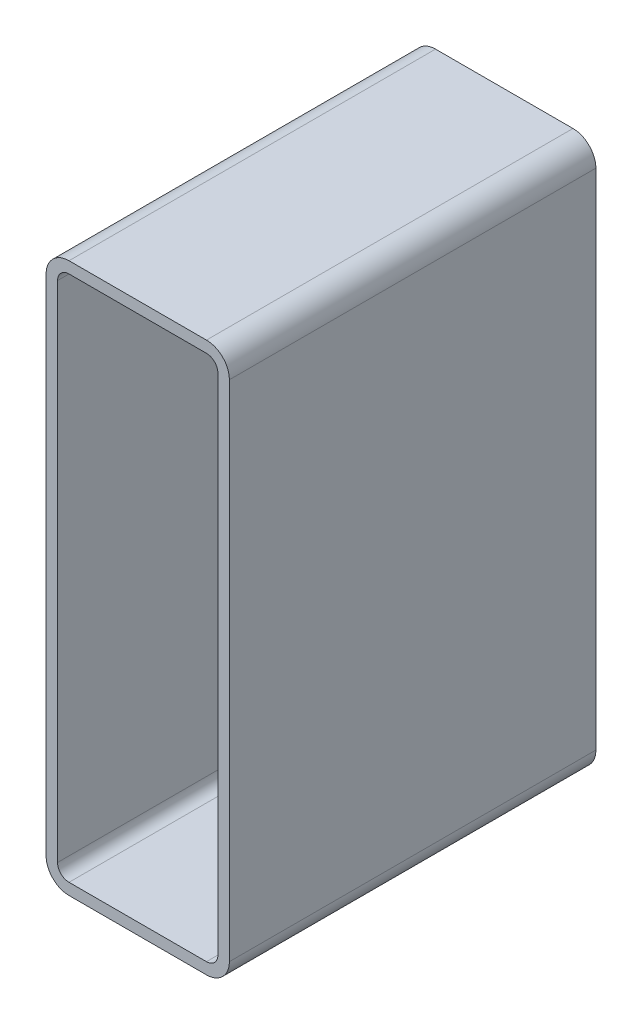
ISO-10303-21;
HEADER;
FILE_DESCRIPTION(('STEP AP214'),'2;1');
FILE_NAME('part.step','',(''),(''),'','','');
FILE_SCHEMA(('AUTOMOTIVE_DESIGN { 1 0 10303 214 1 1 1 1 }'));
ENDSEC;
DATA;
#1=APPLICATION_CONTEXT('core data for automotive mechanical design processes');
#2=APPLICATION_PROTOCOL_DEFINITION('international standard','automotive_design',2000,#1);
#3=PRODUCT_CONTEXT('',#1,'mechanical');
#4=PRODUCT('Part','Part','',(#3));
#5=PRODUCT_RELATED_PRODUCT_CATEGORY('part','',(#4));
#6=PRODUCT_DEFINITION_FORMATION('','',#4);
#7=PRODUCT_DEFINITION_CONTEXT('part definition',#1,'design');
#8=PRODUCT_DEFINITION('design','',#6,#7);
#9=PRODUCT_DEFINITION_SHAPE('','',#8);
#10=(LENGTH_UNIT() NAMED_UNIT(*) SI_UNIT(.MILLI.,.METRE.));
#11=(NAMED_UNIT(*) PLANE_ANGLE_UNIT() SI_UNIT($,.RADIAN.));
#12=(NAMED_UNIT(*) SI_UNIT($,.STERADIAN.) SOLID_ANGLE_UNIT());
#13=UNCERTAINTY_MEASURE_WITH_UNIT(LENGTH_MEASURE(1.E-05),#10,'distance_accuracy_value','');
#14=(GEOMETRIC_REPRESENTATION_CONTEXT(3) GLOBAL_UNCERTAINTY_ASSIGNED_CONTEXT((#13)) GLOBAL_UNIT_ASSIGNED_CONTEXT((#10,
#11,#12)) REPRESENTATION_CONTEXT('',''));
#15=CARTESIAN_POINT('',(0.,0.,0.));
#16=DIRECTION('',(0.,0.,1.));
#17=DIRECTION('',(1.,0.,0.));
#18=AXIS2_PLACEMENT_3D('',#15,#16,#17);
#19=CARTESIAN_POINT('',(19.0973013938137,439.887045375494,304.8));
#20=DIRECTION('',(0.,0.,1.));
#21=DIRECTION('',(1.,0.,0.));
#22=AXIS2_PLACEMENT_3D('',#19,#20,#21);
#23=PLANE('',#22);
#24=CARTESIAN_POINT('',(19.0973013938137,439.887045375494,304.8));
#25=DIRECTION('',(0.,0.,1.));
#26=DIRECTION('',(1.,0.,0.));
#27=AXIS2_PLACEMENT_3D('',#24,#25,#26);
#28=CIRCLE('',#27,19.05);
#29=CARTESIAN_POINT('',(19.0973013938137,458.937045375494,304.8));
#30=VERTEX_POINT('',#29);
#31=CARTESIAN_POINT('',(0.0473013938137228,439.887045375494,304.8));
#32=VERTEX_POINT('',#31);
#33=EDGE_CURVE('E211',#30,#32,#28,.T.);
#34=ORIENTED_EDGE('',*,*,#33,.T.);
#35=DIRECTION('',(0.,-1.,0.));
#36=VECTOR('',#35,1.);
#37=CARTESIAN_POINT('',(0.0473013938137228,20.7870453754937,304.8));
#38=LINE('',#37,#36);
#39=CARTESIAN_POINT('',(0.0473013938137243,20.7870453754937,304.8));
#40=VERTEX_POINT('',#39);
#41=EDGE_CURVE('E214',#32,#40,#38,.T.);
#42=ORIENTED_EDGE('',*,*,#41,.T.);
#43=CARTESIAN_POINT('',(19.0973013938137,20.7870453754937,304.8));
#44=DIRECTION('',(0.,0.,1.));
#45=DIRECTION('',(1.,0.,0.));
#46=AXIS2_PLACEMENT_3D('',#43,#44,#45);
#47=CIRCLE('',#46,19.05);
#48=CARTESIAN_POINT('',(19.0973013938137,1.73704537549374,304.8));
#49=VERTEX_POINT('',#48);
#50=EDGE_CURVE('E217',#40,#49,#47,.T.);
#51=ORIENTED_EDGE('',*,*,#50,.T.);
#52=DIRECTION('',(1.,0.,0.));
#53=VECTOR('',#52,1.);
#54=CARTESIAN_POINT('',(133.397301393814,1.73704537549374,304.8));
#55=LINE('',#54,#53);
#56=CARTESIAN_POINT('',(133.397301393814,1.73704537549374,304.8));
#57=VERTEX_POINT('',#56);
#58=EDGE_CURVE('E219',#49,#57,#55,.T.);
#59=ORIENTED_EDGE('',*,*,#58,.T.);
#60=CARTESIAN_POINT('',(133.397301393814,20.7870453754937,304.8));
#61=DIRECTION('',(0.,0.,1.));
#62=DIRECTION('',(1.,0.,0.));
#63=AXIS2_PLACEMENT_3D('',#60,#61,#62);
#64=CIRCLE('',#63,19.05);
#65=CARTESIAN_POINT('',(152.447301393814,20.7870453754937,304.8));
#66=VERTEX_POINT('',#65);
#67=EDGE_CURVE('E221',#57,#66,#64,.T.);
#68=ORIENTED_EDGE('',*,*,#67,.T.);
#69=DIRECTION('',(0.,1.,0.));
#70=VECTOR('',#69,1.);
#71=CARTESIAN_POINT('',(152.447301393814,439.887045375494,304.8));
#72=LINE('',#71,#70);
#73=CARTESIAN_POINT('',(152.447301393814,439.887045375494,304.8));
#74=VERTEX_POINT('',#73);
#75=EDGE_CURVE('E223',#66,#74,#72,.T.);
#76=ORIENTED_EDGE('',*,*,#75,.T.);
#77=CARTESIAN_POINT('',(133.397301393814,439.887045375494,304.8));
#78=DIRECTION('',(0.,0.,1.));
#79=DIRECTION('',(1.,0.,0.));
#80=AXIS2_PLACEMENT_3D('',#77,#78,#79);
#81=CIRCLE('',#80,19.05);
#82=CARTESIAN_POINT('',(133.397301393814,458.937045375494,304.8));
#83=VERTEX_POINT('',#82);
#84=EDGE_CURVE('E225',#74,#83,#81,.T.);
#85=ORIENTED_EDGE('',*,*,#84,.T.);
#86=DIRECTION('',(-1.,0.,0.));
#87=VECTOR('',#86,1.);
#88=CARTESIAN_POINT('',(19.0973013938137,458.937045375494,304.8));
#89=LINE('',#88,#87);
#90=EDGE_CURVE('E227',#83,#30,#89,.T.);
#91=ORIENTED_EDGE('',*,*,#90,.T.);
#92=EDGE_LOOP('',(#34,#42,#51,#59,#68,#76,#85,#91));
#93=FACE_BOUND('',#92,.T.);
#94=DIRECTION('',(0.,-1.,0.));
#95=VECTOR('',#94,1.);
#96=CARTESIAN_POINT('',(9.57230139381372,20.7870453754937,304.8));
#97=LINE('',#96,#95);
#98=CARTESIAN_POINT('',(9.57230139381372,439.887045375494,304.8));
#99=VERTEX_POINT('',#98);
#100=CARTESIAN_POINT('',(9.57230139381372,20.7870453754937,304.8));
#101=VERTEX_POINT('',#100);
#102=EDGE_CURVE('E154',#99,#101,#97,.T.);
#103=ORIENTED_EDGE('',*,*,#102,.F.);
#104=CARTESIAN_POINT('',(19.0973013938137,439.887045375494,304.8));
#105=DIRECTION('',(0.,0.,1.));
#106=DIRECTION('',(1.,0.,0.));
#107=AXIS2_PLACEMENT_3D('',#104,#105,#106);
#108=CIRCLE('',#107,9.52500000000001);
#109=CARTESIAN_POINT('',(19.0973013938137,449.412045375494,304.8));
#110=VERTEX_POINT('',#109);
#111=EDGE_CURVE('E146',#110,#99,#108,.T.);
#112=ORIENTED_EDGE('',*,*,#111,.F.);
#113=DIRECTION('',(-1.,0.,0.));
#114=VECTOR('',#113,1.);
#115=CARTESIAN_POINT('',(19.0973013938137,449.412045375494,304.8));
#116=LINE('',#115,#114);
#117=CARTESIAN_POINT('',(133.397301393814,449.412045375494,304.8));
#118=VERTEX_POINT('',#117);
#119=EDGE_CURVE('E179',#118,#110,#116,.T.);
#120=ORIENTED_EDGE('',*,*,#119,.F.);
#121=CARTESIAN_POINT('',(133.397301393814,439.887045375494,304.8));
#122=DIRECTION('',(0.,0.,1.));
#123=DIRECTION('',(1.,0.,0.));
#124=AXIS2_PLACEMENT_3D('',#121,#122,#123);
#125=CIRCLE('',#124,9.52500000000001);
#126=CARTESIAN_POINT('',(142.922301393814,439.887045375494,304.8));
#127=VERTEX_POINT('',#126);
#128=EDGE_CURVE('E177',#127,#118,#125,.T.);
#129=ORIENTED_EDGE('',*,*,#128,.F.);
#130=DIRECTION('',(0.,1.,0.));
#131=VECTOR('',#130,1.);
#132=CARTESIAN_POINT('',(142.922301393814,439.887045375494,304.8));
#133=LINE('',#132,#131);
#134=CARTESIAN_POINT('',(142.922301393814,20.7870453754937,304.8));
#135=VERTEX_POINT('',#134);
#136=EDGE_CURVE('E175',#135,#127,#133,.T.);
#137=ORIENTED_EDGE('',*,*,#136,.F.);
#138=CARTESIAN_POINT('',(133.397301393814,20.7870453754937,304.8));
#139=DIRECTION('',(0.,0.,1.));
#140=DIRECTION('',(1.,0.,0.));
#141=AXIS2_PLACEMENT_3D('',#138,#139,#140);
#142=CIRCLE('',#141,9.525);
#143=CARTESIAN_POINT('',(133.397301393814,11.2620453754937,304.8));
#144=VERTEX_POINT('',#143);
#145=EDGE_CURVE('E173',#144,#135,#142,.T.);
#146=ORIENTED_EDGE('',*,*,#145,.F.);
#147=DIRECTION('',(1.,0.,0.));
#148=VECTOR('',#147,1.);
#149=CARTESIAN_POINT('',(133.397301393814,11.2620453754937,304.8));
#150=LINE('',#149,#148);
#151=CARTESIAN_POINT('',(19.0973013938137,11.2620453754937,304.8));
#152=VERTEX_POINT('',#151);
#153=EDGE_CURVE('E169',#152,#144,#150,.T.);
#154=ORIENTED_EDGE('',*,*,#153,.F.);
#155=CARTESIAN_POINT('',(19.0973013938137,20.7870453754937,304.8));
#156=DIRECTION('',(0.,0.,1.));
#157=DIRECTION('',(1.,0.,0.));
#158=AXIS2_PLACEMENT_3D('',#155,#156,#157);
#159=CIRCLE('',#158,9.525);
#160=EDGE_CURVE('E167',#101,#152,#159,.T.);
#161=ORIENTED_EDGE('',*,*,#160,.F.);
#162=EDGE_LOOP('',(#103,#112,#120,#129,#137,#146,#154,#161));
#163=FACE_BOUND('',#162,.T.);
#164=ADVANCED_FACE('F33',(#93,#163),#23,.T.);
#165=CARTESIAN_POINT('',(19.0973013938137,439.887045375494,0.));
#166=DIRECTION('',(0.,0.,1.));
#167=DIRECTION('',(1.,0.,0.));
#168=AXIS2_PLACEMENT_3D('',#165,#166,#167);
#169=PLANE('',#168);
#170=CARTESIAN_POINT('',(19.0973013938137,439.887045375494,0.));
#171=DIRECTION('',(0.,0.,1.));
#172=DIRECTION('',(1.,0.,0.));
#173=AXIS2_PLACEMENT_3D('',#170,#171,#172);
#174=CIRCLE('',#173,19.05);
#175=CARTESIAN_POINT('',(19.0973013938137,458.937045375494,0.));
#176=VERTEX_POINT('',#175);
#177=CARTESIAN_POINT('',(0.0473013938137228,439.887045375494,0.));
#178=VERTEX_POINT('',#177);
#179=EDGE_CURVE('E162',#176,#178,#174,.T.);
#180=ORIENTED_EDGE('',*,*,#179,.F.);
#181=DIRECTION('',(-1.,0.,0.));
#182=VECTOR('',#181,1.);
#183=CARTESIAN_POINT('',(19.0973013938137,458.937045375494,0.));
#184=LINE('',#183,#182);
#185=CARTESIAN_POINT('',(133.397301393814,458.937045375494,0.));
#186=VERTEX_POINT('',#185);
#187=EDGE_CURVE('E215',#186,#176,#184,.T.);
#188=ORIENTED_EDGE('',*,*,#187,.F.);
#189=CARTESIAN_POINT('',(133.397301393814,439.887045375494,0.));
#190=DIRECTION('',(0.,0.,1.));
#191=DIRECTION('',(1.,0.,0.));
#192=AXIS2_PLACEMENT_3D('',#189,#190,#191);
#193=CIRCLE('',#192,19.05);
#194=CARTESIAN_POINT('',(152.447301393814,439.887045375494,0.));
#195=VERTEX_POINT('',#194);
#196=EDGE_CURVE('E242',#195,#186,#193,.T.);
#197=ORIENTED_EDGE('',*,*,#196,.F.);
#198=DIRECTION('',(0.,1.,0.));
#199=VECTOR('',#198,1.);
#200=CARTESIAN_POINT('',(152.447301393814,439.887045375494,0.));
#201=LINE('',#200,#199);
#202=CARTESIAN_POINT('',(152.447301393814,20.7870453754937,0.));
#203=VERTEX_POINT('',#202);
#204=EDGE_CURVE('E240',#203,#195,#201,.T.);
#205=ORIENTED_EDGE('',*,*,#204,.F.);
#206=CARTESIAN_POINT('',(133.397301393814,20.7870453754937,0.));
#207=DIRECTION('',(0.,0.,1.));
#208=DIRECTION('',(1.,0.,0.));
#209=AXIS2_PLACEMENT_3D('',#206,#207,#208);
#210=CIRCLE('',#209,19.05);
#211=CARTESIAN_POINT('',(133.397301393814,1.73704537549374,0.));
#212=VERTEX_POINT('',#211);
#213=EDGE_CURVE('E238',#212,#203,#210,.T.);
#214=ORIENTED_EDGE('',*,*,#213,.F.);
#215=DIRECTION('',(1.,0.,0.));
#216=VECTOR('',#215,1.);
#217=CARTESIAN_POINT('',(133.397301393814,1.73704537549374,0.));
#218=LINE('',#217,#216);
#219=CARTESIAN_POINT('',(19.0973013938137,1.73704537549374,0.));
#220=VERTEX_POINT('',#219);
#221=EDGE_CURVE('E236',#220,#212,#218,.T.);
#222=ORIENTED_EDGE('',*,*,#221,.F.);
#223=CARTESIAN_POINT('',(19.0973013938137,20.7870453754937,0.));
#224=DIRECTION('',(0.,0.,1.));
#225=DIRECTION('',(1.,0.,0.));
#226=AXIS2_PLACEMENT_3D('',#223,#224,#225);
#227=CIRCLE('',#226,19.05);
#228=CARTESIAN_POINT('',(0.0473013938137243,20.7870453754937,0.));
#229=VERTEX_POINT('',#228);
#230=EDGE_CURVE('E234',#229,#220,#227,.T.);
#231=ORIENTED_EDGE('',*,*,#230,.F.);
#232=DIRECTION('',(0.,-1.,0.));
#233=VECTOR('',#232,1.);
#234=CARTESIAN_POINT('',(0.0473013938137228,20.7870453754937,0.));
#235=LINE('',#234,#233);
#236=EDGE_CURVE('E232',#178,#229,#235,.T.);
#237=ORIENTED_EDGE('',*,*,#236,.F.);
#238=EDGE_LOOP('',(#180,#188,#197,#205,#214,#222,#231,#237));
#239=FACE_BOUND('',#238,.T.);
#240=CARTESIAN_POINT('',(19.0973013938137,439.887045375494,0.));
#241=DIRECTION('',(0.,0.,1.));
#242=DIRECTION('',(1.,0.,0.));
#243=AXIS2_PLACEMENT_3D('',#240,#241,#242);
#244=CIRCLE('',#243,9.52500000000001);
#245=CARTESIAN_POINT('',(19.0973013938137,449.412045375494,0.));
#246=VERTEX_POINT('',#245);
#247=CARTESIAN_POINT('',(9.57230139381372,439.887045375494,0.));
#248=VERTEX_POINT('',#247);
#249=EDGE_CURVE('E56',#246,#248,#244,.T.);
#250=ORIENTED_EDGE('',*,*,#249,.T.);
#251=DIRECTION('',(0.,-1.,0.));
#252=VECTOR('',#251,1.);
#253=CARTESIAN_POINT('',(9.57230139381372,20.7870453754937,0.));
#254=LINE('',#253,#252);
#255=CARTESIAN_POINT('',(9.57230139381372,20.7870453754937,0.));
#256=VERTEX_POINT('',#255);
#257=EDGE_CURVE('E161',#248,#256,#254,.T.);
#258=ORIENTED_EDGE('',*,*,#257,.T.);
#259=CARTESIAN_POINT('',(19.0973013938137,20.7870453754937,0.));
#260=DIRECTION('',(0.,0.,1.));
#261=DIRECTION('',(1.,0.,0.));
#262=AXIS2_PLACEMENT_3D('',#259,#260,#261);
#263=CIRCLE('',#262,9.525);
#264=CARTESIAN_POINT('',(19.0973013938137,11.2620453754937,0.));
#265=VERTEX_POINT('',#264);
#266=EDGE_CURVE('E183',#256,#265,#263,.T.);
#267=ORIENTED_EDGE('',*,*,#266,.T.);
#268=DIRECTION('',(1.,0.,0.));
#269=VECTOR('',#268,1.);
#270=CARTESIAN_POINT('',(133.397301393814,11.2620453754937,0.));
#271=LINE('',#270,#269);
#272=CARTESIAN_POINT('',(133.397301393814,11.2620453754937,0.));
#273=VERTEX_POINT('',#272);
#274=EDGE_CURVE('E186',#265,#273,#271,.T.);
#275=ORIENTED_EDGE('',*,*,#274,.T.);
#276=CARTESIAN_POINT('',(133.397301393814,20.7870453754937,0.));
#277=DIRECTION('',(0.,0.,1.));
#278=DIRECTION('',(1.,0.,0.));
#279=AXIS2_PLACEMENT_3D('',#276,#277,#278);
#280=CIRCLE('',#279,9.525);
#281=CARTESIAN_POINT('',(142.922301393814,20.7870453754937,0.));
#282=VERTEX_POINT('',#281);
#283=EDGE_CURVE('E189',#273,#282,#280,.T.);
#284=ORIENTED_EDGE('',*,*,#283,.T.);
#285=DIRECTION('',(0.,1.,0.));
#286=VECTOR('',#285,1.);
#287=CARTESIAN_POINT('',(142.922301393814,439.887045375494,0.));
#288=LINE('',#287,#286);
#289=CARTESIAN_POINT('',(142.922301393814,439.887045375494,0.));
#290=VERTEX_POINT('',#289);
#291=EDGE_CURVE('E192',#282,#290,#288,.T.);
#292=ORIENTED_EDGE('',*,*,#291,.T.);
#293=CARTESIAN_POINT('',(133.397301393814,439.887045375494,0.));
#294=DIRECTION('',(0.,0.,1.));
#295=DIRECTION('',(1.,0.,0.));
#296=AXIS2_PLACEMENT_3D('',#293,#294,#295);
#297=CIRCLE('',#296,9.52500000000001);
#298=CARTESIAN_POINT('',(133.397301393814,449.412045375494,0.));
#299=VERTEX_POINT('',#298);
#300=EDGE_CURVE('E195',#290,#299,#297,.T.);
#301=ORIENTED_EDGE('',*,*,#300,.T.);
#302=DIRECTION('',(-1.,0.,0.));
#303=VECTOR('',#302,1.);
#304=CARTESIAN_POINT('',(19.0973013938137,449.412045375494,0.));
#305=LINE('',#304,#303);
#306=EDGE_CURVE('E155',#299,#246,#305,.T.);
#307=ORIENTED_EDGE('',*,*,#306,.T.);
#308=EDGE_LOOP('',(#250,#258,#267,#275,#284,#292,#301,#307));
#309=FACE_BOUND('',#308,.T.);
#310=ADVANCED_FACE('F272',(#239,#309),#169,.F.);
#311=CARTESIAN_POINT('',(19.0973013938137,439.887045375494,304.8));
#312=DIRECTION('',(0.,0.,-1.));
#313=DIRECTION('',(-1.,0.,0.));
#314=AXIS2_PLACEMENT_3D('',#311,#312,#313);
#315=CYLINDRICAL_SURFACE('',#314,19.05);
#316=ORIENTED_EDGE('',*,*,#179,.T.);
#317=DIRECTION('',(0.,0.,-1.));
#318=VECTOR('',#317,1.);
#319=CARTESIAN_POINT('',(0.0473013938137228,439.887045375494,304.8));
#320=LINE('',#319,#318);
#321=EDGE_CURVE('E11',#32,#178,#320,.T.);
#322=ORIENTED_EDGE('',*,*,#321,.F.);
#323=ORIENTED_EDGE('',*,*,#33,.F.);
#324=DIRECTION('',(0.,0.,-1.));
#325=VECTOR('',#324,1.);
#326=CARTESIAN_POINT('',(19.0973013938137,458.937045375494,304.8));
#327=LINE('',#326,#325);
#328=EDGE_CURVE('E229',#30,#176,#327,.T.);
#329=ORIENTED_EDGE('',*,*,#328,.T.);
#330=EDGE_LOOP('',(#316,#322,#323,#329));
#331=FACE_BOUND('',#330,.T.);
#332=ADVANCED_FACE('F35',(#331),#315,.T.);
#333=CARTESIAN_POINT('',(0.0473013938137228,20.7870453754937,304.8));
#334=DIRECTION('',(1.,0.,0.));
#335=DIRECTION('',(0.,0.,-1.));
#336=AXIS2_PLACEMENT_3D('',#333,#334,#335);
#337=PLANE('',#336);
#338=ORIENTED_EDGE('',*,*,#236,.T.);
#339=DIRECTION('',(0.,0.,-1.));
#340=VECTOR('',#339,1.);
#341=CARTESIAN_POINT('',(0.0473013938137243,20.7870453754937,304.8));
#342=LINE('',#341,#340);
#343=EDGE_CURVE('E41',#40,#229,#342,.T.);
#344=ORIENTED_EDGE('',*,*,#343,.F.);
#345=ORIENTED_EDGE('',*,*,#41,.F.);
#346=ORIENTED_EDGE('',*,*,#321,.T.);
#347=EDGE_LOOP('',(#338,#344,#345,#346));
#348=FACE_BOUND('',#347,.T.);
#349=ADVANCED_FACE('F289',(#348),#337,.F.);
#350=CARTESIAN_POINT('',(19.0973013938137,20.7870453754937,304.8));
#351=DIRECTION('',(0.,0.,-1.));
#352=DIRECTION('',(-1.,0.,0.));
#353=AXIS2_PLACEMENT_3D('',#350,#351,#352);
#354=CYLINDRICAL_SURFACE('',#353,19.05);
#355=ORIENTED_EDGE('',*,*,#230,.T.);
#356=DIRECTION('',(0.,0.,-1.));
#357=VECTOR('',#356,1.);
#358=CARTESIAN_POINT('',(19.0973013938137,1.73704537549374,304.8));
#359=LINE('',#358,#357);
#360=EDGE_CURVE('E259',#49,#220,#359,.T.);
#361=ORIENTED_EDGE('',*,*,#360,.F.);
#362=ORIENTED_EDGE('',*,*,#50,.F.);
#363=ORIENTED_EDGE('',*,*,#343,.T.);
#364=EDGE_LOOP('',(#355,#361,#362,#363));
#365=FACE_BOUND('',#364,.T.);
#366=ADVANCED_FACE('F266',(#365),#354,.T.);
#367=CARTESIAN_POINT('',(133.397301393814,1.73704537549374,304.8));
#368=DIRECTION('',(0.,1.,0.));
#369=DIRECTION('',(0.,0.,1.));
#370=AXIS2_PLACEMENT_3D('',#367,#368,#369);
#371=PLANE('',#370);
#372=ORIENTED_EDGE('',*,*,#221,.T.);
#373=DIRECTION('',(0.,0.,-1.));
#374=VECTOR('',#373,1.);
#375=CARTESIAN_POINT('',(133.397301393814,1.73704537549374,304.8));
#376=LINE('',#375,#374);
#377=EDGE_CURVE('E256',#57,#212,#376,.T.);
#378=ORIENTED_EDGE('',*,*,#377,.F.);
#379=ORIENTED_EDGE('',*,*,#58,.F.);
#380=ORIENTED_EDGE('',*,*,#360,.T.);
#381=EDGE_LOOP('',(#372,#378,#379,#380));
#382=FACE_BOUND('',#381,.T.);
#383=ADVANCED_FACE('F278',(#382),#371,.F.);
#384=CARTESIAN_POINT('',(133.397301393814,20.7870453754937,304.8));
#385=DIRECTION('',(0.,0.,-1.));
#386=DIRECTION('',(-1.,0.,0.));
#387=AXIS2_PLACEMENT_3D('',#384,#385,#386);
#388=CYLINDRICAL_SURFACE('',#387,19.05);
#389=ORIENTED_EDGE('',*,*,#213,.T.);
#390=DIRECTION('',(0.,0.,-1.));
#391=VECTOR('',#390,1.);
#392=CARTESIAN_POINT('',(152.447301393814,20.7870453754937,304.8));
#393=LINE('',#392,#391);
#394=EDGE_CURVE('E253',#66,#203,#393,.T.);
#395=ORIENTED_EDGE('',*,*,#394,.F.);
#396=ORIENTED_EDGE('',*,*,#67,.F.);
#397=ORIENTED_EDGE('',*,*,#377,.T.);
#398=EDGE_LOOP('',(#389,#395,#396,#397));
#399=FACE_BOUND('',#398,.T.);
#400=ADVANCED_FACE('F282',(#399),#388,.T.);
#401=CARTESIAN_POINT('',(152.447301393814,439.887045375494,304.8));
#402=DIRECTION('',(-1.,0.,0.));
#403=DIRECTION('',(0.,0.,1.));
#404=AXIS2_PLACEMENT_3D('',#401,#402,#403);
#405=PLANE('',#404);
#406=ORIENTED_EDGE('',*,*,#204,.T.);
#407=DIRECTION('',(0.,0.,-1.));
#408=VECTOR('',#407,1.);
#409=CARTESIAN_POINT('',(152.447301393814,439.887045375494,304.8));
#410=LINE('',#409,#408);
#411=EDGE_CURVE('E250',#74,#195,#410,.T.);
#412=ORIENTED_EDGE('',*,*,#411,.F.);
#413=ORIENTED_EDGE('',*,*,#75,.F.);
#414=ORIENTED_EDGE('',*,*,#394,.T.);
#415=EDGE_LOOP('',(#406,#412,#413,#414));
#416=FACE_BOUND('',#415,.T.);
#417=ADVANCED_FACE('F302',(#416),#405,.F.);
#418=CARTESIAN_POINT('',(133.397301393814,439.887045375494,304.8));
#419=DIRECTION('',(0.,0.,-1.));
#420=DIRECTION('',(-1.,0.,0.));
#421=AXIS2_PLACEMENT_3D('',#418,#419,#420);
#422=CYLINDRICAL_SURFACE('',#421,19.05);
#423=ORIENTED_EDGE('',*,*,#196,.T.);
#424=DIRECTION('',(0.,0.,-1.));
#425=VECTOR('',#424,1.);
#426=CARTESIAN_POINT('',(133.397301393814,458.937045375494,304.8));
#427=LINE('',#426,#425);
#428=EDGE_CURVE('E247',#83,#186,#427,.T.);
#429=ORIENTED_EDGE('',*,*,#428,.F.);
#430=ORIENTED_EDGE('',*,*,#84,.F.);
#431=ORIENTED_EDGE('',*,*,#411,.T.);
#432=EDGE_LOOP('',(#423,#429,#430,#431));
#433=FACE_BOUND('',#432,.T.);
#434=ADVANCED_FACE('F300',(#433),#422,.T.);
#435=CARTESIAN_POINT('',(19.0973013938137,458.937045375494,304.8));
#436=DIRECTION('',(0.,-1.,0.));
#437=DIRECTION('',(0.,0.,-1.));
#438=AXIS2_PLACEMENT_3D('',#435,#436,#437);
#439=PLANE('',#438);
#440=ORIENTED_EDGE('',*,*,#187,.T.);
#441=ORIENTED_EDGE('',*,*,#328,.F.);
#442=ORIENTED_EDGE('',*,*,#90,.F.);
#443=ORIENTED_EDGE('',*,*,#428,.T.);
#444=EDGE_LOOP('',(#440,#441,#442,#443));
#445=FACE_BOUND('',#444,.T.);
#446=ADVANCED_FACE('F295',(#445),#439,.F.);
#447=CARTESIAN_POINT('',(19.0973013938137,439.887045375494,304.8));
#448=DIRECTION('',(0.,0.,-1.));
#449=DIRECTION('',(-1.,0.,0.));
#450=AXIS2_PLACEMENT_3D('',#447,#448,#449);
#451=CYLINDRICAL_SURFACE('',#450,9.52500000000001);
#452=ORIENTED_EDGE('',*,*,#249,.F.);
#453=DIRECTION('',(0.,0.,-1.));
#454=VECTOR('',#453,1.);
#455=CARTESIAN_POINT('',(19.0973013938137,449.412045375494,304.8));
#456=LINE('',#455,#454);
#457=EDGE_CURVE('E150',#110,#246,#456,.T.);
#458=ORIENTED_EDGE('',*,*,#457,.F.);
#459=ORIENTED_EDGE('',*,*,#111,.T.);
#460=DIRECTION('',(0.,0.,-1.));
#461=VECTOR('',#460,1.);
#462=CARTESIAN_POINT('',(9.57230139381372,439.887045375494,304.8));
#463=LINE('',#462,#461);
#464=EDGE_CURVE('E149',#99,#248,#463,.T.);
#465=ORIENTED_EDGE('',*,*,#464,.T.);
#466=EDGE_LOOP('',(#452,#458,#459,#465));
#467=FACE_BOUND('',#466,.T.);
#468=ADVANCED_FACE('F148',(#467),#451,.F.);
#469=CARTESIAN_POINT('',(9.57230139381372,20.7870453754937,304.8));
#470=DIRECTION('',(1.,0.,0.));
#471=DIRECTION('',(0.,0.,-1.));
#472=AXIS2_PLACEMENT_3D('',#469,#470,#471);
#473=PLANE('',#472);
#474=ORIENTED_EDGE('',*,*,#257,.F.);
#475=ORIENTED_EDGE('',*,*,#464,.F.);
#476=ORIENTED_EDGE('',*,*,#102,.T.);
#477=DIRECTION('',(0.,0.,-1.));
#478=VECTOR('',#477,1.);
#479=CARTESIAN_POINT('',(9.57230139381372,20.7870453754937,304.8));
#480=LINE('',#479,#478);
#481=EDGE_CURVE('E163',#101,#256,#480,.T.);
#482=ORIENTED_EDGE('',*,*,#481,.T.);
#483=EDGE_LOOP('',(#474,#475,#476,#482));
#484=FACE_BOUND('',#483,.T.);
#485=ADVANCED_FACE('F158',(#484),#473,.T.);
#486=CARTESIAN_POINT('',(19.0973013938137,20.7870453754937,304.8));
#487=DIRECTION('',(0.,0.,-1.));
#488=DIRECTION('',(-1.,0.,0.));
#489=AXIS2_PLACEMENT_3D('',#486,#487,#488);
#490=CYLINDRICAL_SURFACE('',#489,9.525);
#491=ORIENTED_EDGE('',*,*,#266,.F.);
#492=ORIENTED_EDGE('',*,*,#481,.F.);
#493=ORIENTED_EDGE('',*,*,#160,.T.);
#494=DIRECTION('',(0.,0.,-1.));
#495=VECTOR('',#494,1.);
#496=CARTESIAN_POINT('',(19.0973013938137,11.2620453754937,304.8));
#497=LINE('',#496,#495);
#498=EDGE_CURVE('E208',#152,#265,#497,.T.);
#499=ORIENTED_EDGE('',*,*,#498,.T.);
#500=EDGE_LOOP('',(#491,#492,#493,#499));
#501=FACE_BOUND('',#500,.T.);
#502=ADVANCED_FACE('F327',(#501),#490,.F.);
#503=CARTESIAN_POINT('',(133.397301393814,11.2620453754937,304.8));
#504=DIRECTION('',(0.,1.,0.));
#505=DIRECTION('',(0.,0.,1.));
#506=AXIS2_PLACEMENT_3D('',#503,#504,#505);
#507=PLANE('',#506);
#508=ORIENTED_EDGE('',*,*,#274,.F.);
#509=ORIENTED_EDGE('',*,*,#498,.F.);
#510=ORIENTED_EDGE('',*,*,#153,.T.);
#511=DIRECTION('',(0.,0.,-1.));
#512=VECTOR('',#511,1.);
#513=CARTESIAN_POINT('',(133.397301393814,11.2620453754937,304.8));
#514=LINE('',#513,#512);
#515=EDGE_CURVE('E206',#144,#273,#514,.T.);
#516=ORIENTED_EDGE('',*,*,#515,.T.);
#517=EDGE_LOOP('',(#508,#509,#510,#516));
#518=FACE_BOUND('',#517,.T.);
#519=ADVANCED_FACE('F331',(#518),#507,.T.);
#520=CARTESIAN_POINT('',(133.397301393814,20.7870453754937,304.8));
#521=DIRECTION('',(0.,0.,-1.));
#522=DIRECTION('',(-1.,0.,0.));
#523=AXIS2_PLACEMENT_3D('',#520,#521,#522);
#524=CYLINDRICAL_SURFACE('',#523,9.525);
#525=ORIENTED_EDGE('',*,*,#283,.F.);
#526=ORIENTED_EDGE('',*,*,#515,.F.);
#527=ORIENTED_EDGE('',*,*,#145,.T.);
#528=DIRECTION('',(0.,0.,-1.));
#529=VECTOR('',#528,1.);
#530=CARTESIAN_POINT('',(142.922301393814,20.7870453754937,304.8));
#531=LINE('',#530,#529);
#532=EDGE_CURVE('E204',#135,#282,#531,.T.);
#533=ORIENTED_EDGE('',*,*,#532,.T.);
#534=EDGE_LOOP('',(#525,#526,#527,#533));
#535=FACE_BOUND('',#534,.T.);
#536=ADVANCED_FACE('F337',(#535),#524,.F.);
#537=CARTESIAN_POINT('',(142.922301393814,439.887045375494,304.8));
#538=DIRECTION('',(-1.,0.,0.));
#539=DIRECTION('',(0.,0.,1.));
#540=AXIS2_PLACEMENT_3D('',#537,#538,#539);
#541=PLANE('',#540);
#542=ORIENTED_EDGE('',*,*,#291,.F.);
#543=ORIENTED_EDGE('',*,*,#532,.F.);
#544=ORIENTED_EDGE('',*,*,#136,.T.);
#545=DIRECTION('',(0.,0.,-1.));
#546=VECTOR('',#545,1.);
#547=CARTESIAN_POINT('',(142.922301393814,439.887045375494,304.8));
#548=LINE('',#547,#546);
#549=EDGE_CURVE('E202',#127,#290,#548,.T.);
#550=ORIENTED_EDGE('',*,*,#549,.T.);
#551=EDGE_LOOP('',(#542,#543,#544,#550));
#552=FACE_BOUND('',#551,.T.);
#553=ADVANCED_FACE('F341',(#552),#541,.T.);
#554=CARTESIAN_POINT('',(133.397301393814,439.887045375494,304.8));
#555=DIRECTION('',(0.,0.,-1.));
#556=DIRECTION('',(-1.,0.,0.));
#557=AXIS2_PLACEMENT_3D('',#554,#555,#556);
#558=CYLINDRICAL_SURFACE('',#557,9.52500000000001);
#559=ORIENTED_EDGE('',*,*,#300,.F.);
#560=ORIENTED_EDGE('',*,*,#549,.F.);
#561=ORIENTED_EDGE('',*,*,#128,.T.);
#562=DIRECTION('',(0.,0.,-1.));
#563=VECTOR('',#562,1.);
#564=CARTESIAN_POINT('',(133.397301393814,449.412045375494,304.8));
#565=LINE('',#564,#563);
#566=EDGE_CURVE('E48',#118,#299,#565,.T.);
#567=ORIENTED_EDGE('',*,*,#566,.T.);
#568=EDGE_LOOP('',(#559,#560,#561,#567));
#569=FACE_BOUND('',#568,.T.);
#570=ADVANCED_FACE('F345',(#569),#558,.F.);
#571=CARTESIAN_POINT('',(19.0973013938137,449.412045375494,304.8));
#572=DIRECTION('',(0.,-1.,0.));
#573=DIRECTION('',(0.,0.,-1.));
#574=AXIS2_PLACEMENT_3D('',#571,#572,#573);
#575=PLANE('',#574);
#576=ORIENTED_EDGE('',*,*,#306,.F.);
#577=ORIENTED_EDGE('',*,*,#566,.F.);
#578=ORIENTED_EDGE('',*,*,#119,.T.);
#579=ORIENTED_EDGE('',*,*,#457,.T.);
#580=EDGE_LOOP('',(#576,#577,#578,#579));
#581=FACE_BOUND('',#580,.T.);
#582=ADVANCED_FACE('F349',(#581),#575,.T.);
#583=CLOSED_SHELL('',(#164,#310,#332,#349,#366,#383,#400,#417,#434,#446,#468,#485,#502,#519,
#536,#553,#570,#582));
#584=MANIFOLD_SOLID_BREP('B2',#583);
#585=ADVANCED_BREP_SHAPE_REPRESENTATION('',(#18,#584),#14);
#586=SHAPE_DEFINITION_REPRESENTATION(#9,#585);
ENDSEC;
END-ISO-10303-21;
